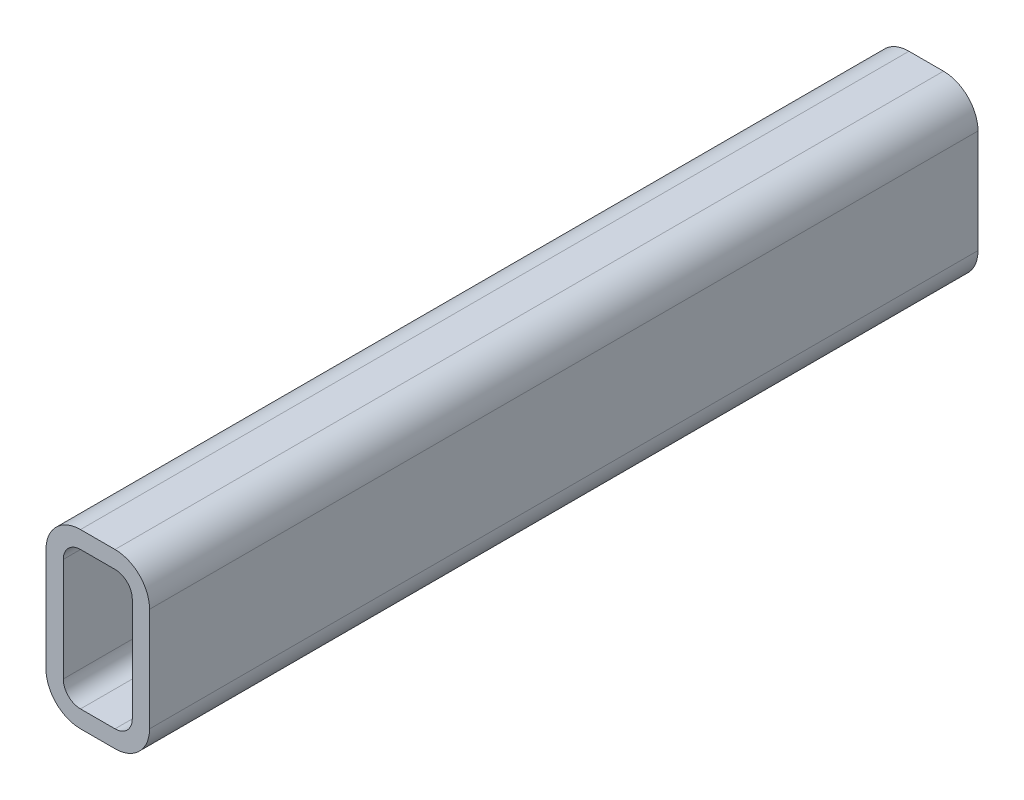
ISO-10303-21;
HEADER;
FILE_DESCRIPTION(('STEP AP214'),'2;1');
FILE_NAME('part.step','',(''),(''),'','','');
FILE_SCHEMA(('AUTOMOTIVE_DESIGN { 1 0 10303 214 1 1 1 1 }'));
ENDSEC;
DATA;
#1=APPLICATION_CONTEXT('core data for automotive mechanical design processes');
#2=APPLICATION_PROTOCOL_DEFINITION('international standard','automotive_design',2000,#1);
#3=PRODUCT_CONTEXT('',#1,'mechanical');
#4=PRODUCT('Part','Part','',(#3));
#5=PRODUCT_RELATED_PRODUCT_CATEGORY('part','',(#4));
#6=PRODUCT_DEFINITION_FORMATION('','',#4);
#7=PRODUCT_DEFINITION_CONTEXT('part definition',#1,'design');
#8=PRODUCT_DEFINITION('design','',#6,#7);
#9=PRODUCT_DEFINITION_SHAPE('','',#8);
#10=(LENGTH_UNIT() NAMED_UNIT(*) SI_UNIT(.MILLI.,.METRE.));
#11=(NAMED_UNIT(*) PLANE_ANGLE_UNIT() SI_UNIT($,.RADIAN.));
#12=(NAMED_UNIT(*) SI_UNIT($,.STERADIAN.) SOLID_ANGLE_UNIT());
#13=UNCERTAINTY_MEASURE_WITH_UNIT(LENGTH_MEASURE(1.E-05),#10,'distance_accuracy_value','');
#14=(GEOMETRIC_REPRESENTATION_CONTEXT(3) GLOBAL_UNCERTAINTY_ASSIGNED_CONTEXT((#13)) GLOBAL_UNIT_ASSIGNED_CONTEXT((#10,
#11,#12)) REPRESENTATION_CONTEXT('',''));
#15=CARTESIAN_POINT('',(0.,0.,0.));
#16=DIRECTION('',(0.,0.,1.));
#17=DIRECTION('',(1.,0.,0.));
#18=AXIS2_PLACEMENT_3D('',#15,#16,#17);
#19=CARTESIAN_POINT('',(12.7,50.8,304.8));
#20=DIRECTION('',(0.,0.,1.));
#21=DIRECTION('',(1.,0.,0.));
#22=AXIS2_PLACEMENT_3D('',#19,#20,#21);
#23=PLANE('',#22);
#24=CARTESIAN_POINT('',(12.7,50.8,304.8));
#25=DIRECTION('',(0.,0.,1.));
#26=DIRECTION('',(1.,0.,0.));
#27=AXIS2_PLACEMENT_3D('',#24,#25,#26);
#28=CIRCLE('',#27,12.7);
#29=CARTESIAN_POINT('',(12.7,63.5,304.8));
#30=VERTEX_POINT('',#29);
#31=CARTESIAN_POINT('',(0.,50.8,304.8));
#32=VERTEX_POINT('',#31);
#33=EDGE_CURVE('E211',#30,#32,#28,.T.);
#34=ORIENTED_EDGE('',*,*,#33,.T.);
#35=DIRECTION('',(0.,-1.,0.));
#36=VECTOR('',#35,1.);
#37=CARTESIAN_POINT('',(0.,12.7,304.8));
#38=LINE('',#37,#36);
#39=CARTESIAN_POINT('',(0.,12.7,304.8));
#40=VERTEX_POINT('',#39);
#41=EDGE_CURVE('E214',#32,#40,#38,.T.);
#42=ORIENTED_EDGE('',*,*,#41,.T.);
#43=CARTESIAN_POINT('',(12.7,12.7,304.8));
#44=DIRECTION('',(0.,0.,1.));
#45=DIRECTION('',(1.,0.,0.));
#46=AXIS2_PLACEMENT_3D('',#43,#44,#45);
#47=CIRCLE('',#46,12.7);
#48=CARTESIAN_POINT('',(12.7,0.,304.8));
#49=VERTEX_POINT('',#48);
#50=EDGE_CURVE('E217',#40,#49,#47,.T.);
#51=ORIENTED_EDGE('',*,*,#50,.T.);
#52=DIRECTION('',(1.,0.,0.));
#53=VECTOR('',#52,1.);
#54=CARTESIAN_POINT('',(25.4,0.,304.8));
#55=LINE('',#54,#53);
#56=CARTESIAN_POINT('',(25.4,0.,304.8));
#57=VERTEX_POINT('',#56);
#58=EDGE_CURVE('E219',#49,#57,#55,.T.);
#59=ORIENTED_EDGE('',*,*,#58,.T.);
#60=CARTESIAN_POINT('',(25.4,12.7,304.8));
#61=DIRECTION('',(0.,0.,1.));
#62=DIRECTION('',(1.,0.,0.));
#63=AXIS2_PLACEMENT_3D('',#60,#61,#62);
#64=CIRCLE('',#63,12.7);
#65=CARTESIAN_POINT('',(38.1,12.7,304.8));
#66=VERTEX_POINT('',#65);
#67=EDGE_CURVE('E221',#57,#66,#64,.T.);
#68=ORIENTED_EDGE('',*,*,#67,.T.);
#69=DIRECTION('',(0.,1.,0.));
#70=VECTOR('',#69,1.);
#71=CARTESIAN_POINT('',(38.1,50.8,304.8));
#72=LINE('',#71,#70);
#73=CARTESIAN_POINT('',(38.1,50.8,304.8));
#74=VERTEX_POINT('',#73);
#75=EDGE_CURVE('E223',#66,#74,#72,.T.);
#76=ORIENTED_EDGE('',*,*,#75,.T.);
#77=CARTESIAN_POINT('',(25.4,50.8,304.8));
#78=DIRECTION('',(0.,0.,1.));
#79=DIRECTION('',(1.,0.,0.));
#80=AXIS2_PLACEMENT_3D('',#77,#78,#79);
#81=CIRCLE('',#80,12.7);
#82=CARTESIAN_POINT('',(25.4,63.5,304.8));
#83=VERTEX_POINT('',#82);
#84=EDGE_CURVE('E225',#74,#83,#81,.T.);
#85=ORIENTED_EDGE('',*,*,#84,.T.);
#86=DIRECTION('',(-1.,0.,0.));
#87=VECTOR('',#86,1.);
#88=CARTESIAN_POINT('',(12.7,63.5,304.8));
#89=LINE('',#88,#87);
#90=EDGE_CURVE('E227',#83,#30,#89,.T.);
#91=ORIENTED_EDGE('',*,*,#90,.T.);
#92=EDGE_LOOP('',(#34,#42,#51,#59,#68,#76,#85,#91));
#93=FACE_BOUND('',#92,.T.);
#94=DIRECTION('',(0.,-1.,0.));
#95=VECTOR('',#94,1.);
#96=CARTESIAN_POINT('',(6.35,12.7,304.8));
#97=LINE('',#96,#95);
#98=CARTESIAN_POINT('',(6.35,50.8,304.8));
#99=VERTEX_POINT('',#98);
#100=CARTESIAN_POINT('',(6.35,12.7,304.8));
#101=VERTEX_POINT('',#100);
#102=EDGE_CURVE('E154',#99,#101,#97,.T.);
#103=ORIENTED_EDGE('',*,*,#102,.F.);
#104=CARTESIAN_POINT('',(12.7,50.8,304.8));
#105=DIRECTION('',(0.,0.,1.));
#106=DIRECTION('',(1.,0.,0.));
#107=AXIS2_PLACEMENT_3D('',#104,#105,#106);
#108=CIRCLE('',#107,6.35);
#109=CARTESIAN_POINT('',(12.7,57.15,304.8));
#110=VERTEX_POINT('',#109);
#111=EDGE_CURVE('E146',#110,#99,#108,.T.);
#112=ORIENTED_EDGE('',*,*,#111,.F.);
#113=DIRECTION('',(-1.,0.,0.));
#114=VECTOR('',#113,1.);
#115=CARTESIAN_POINT('',(12.7,57.15,304.8));
#116=LINE('',#115,#114);
#117=CARTESIAN_POINT('',(25.4,57.15,304.8));
#118=VERTEX_POINT('',#117);
#119=EDGE_CURVE('E179',#118,#110,#116,.T.);
#120=ORIENTED_EDGE('',*,*,#119,.F.);
#121=CARTESIAN_POINT('',(25.4,50.8,304.8));
#122=DIRECTION('',(0.,0.,1.));
#123=DIRECTION('',(1.,0.,0.));
#124=AXIS2_PLACEMENT_3D('',#121,#122,#123);
#125=CIRCLE('',#124,6.35);
#126=CARTESIAN_POINT('',(31.75,50.8,304.8));
#127=VERTEX_POINT('',#126);
#128=EDGE_CURVE('E177',#127,#118,#125,.T.);
#129=ORIENTED_EDGE('',*,*,#128,.F.);
#130=DIRECTION('',(0.,1.,0.));
#131=VECTOR('',#130,1.);
#132=CARTESIAN_POINT('',(31.75,50.8,304.8));
#133=LINE('',#132,#131);
#134=CARTESIAN_POINT('',(31.75,12.7,304.8));
#135=VERTEX_POINT('',#134);
#136=EDGE_CURVE('E175',#135,#127,#133,.T.);
#137=ORIENTED_EDGE('',*,*,#136,.F.);
#138=CARTESIAN_POINT('',(25.4,12.7,304.8));
#139=DIRECTION('',(0.,0.,1.));
#140=DIRECTION('',(1.,0.,0.));
#141=AXIS2_PLACEMENT_3D('',#138,#139,#140);
#142=CIRCLE('',#141,6.35);
#143=CARTESIAN_POINT('',(25.4,6.35,304.8));
#144=VERTEX_POINT('',#143);
#145=EDGE_CURVE('E173',#144,#135,#142,.T.);
#146=ORIENTED_EDGE('',*,*,#145,.F.);
#147=DIRECTION('',(1.,0.,0.));
#148=VECTOR('',#147,1.);
#149=CARTESIAN_POINT('',(25.4,6.35,304.8));
#150=LINE('',#149,#148);
#151=CARTESIAN_POINT('',(12.7,6.35,304.8));
#152=VERTEX_POINT('',#151);
#153=EDGE_CURVE('E169',#152,#144,#150,.T.);
#154=ORIENTED_EDGE('',*,*,#153,.F.);
#155=CARTESIAN_POINT('',(12.7,12.7,304.8));
#156=DIRECTION('',(0.,0.,1.));
#157=DIRECTION('',(1.,0.,0.));
#158=AXIS2_PLACEMENT_3D('',#155,#156,#157);
#159=CIRCLE('',#158,6.35);
#160=EDGE_CURVE('E167',#101,#152,#159,.T.);
#161=ORIENTED_EDGE('',*,*,#160,.F.);
#162=EDGE_LOOP('',(#103,#112,#120,#129,#137,#146,#154,#161));
#163=FACE_BOUND('',#162,.T.);
#164=ADVANCED_FACE('F33',(#93,#163),#23,.T.);
#165=CARTESIAN_POINT('',(12.7,50.8,0.));
#166=DIRECTION('',(0.,0.,1.));
#167=DIRECTION('',(1.,0.,0.));
#168=AXIS2_PLACEMENT_3D('',#165,#166,#167);
#169=PLANE('',#168);
#170=CARTESIAN_POINT('',(12.7,50.8,0.));
#171=DIRECTION('',(0.,0.,1.));
#172=DIRECTION('',(1.,0.,0.));
#173=AXIS2_PLACEMENT_3D('',#170,#171,#172);
#174=CIRCLE('',#173,12.7);
#175=CARTESIAN_POINT('',(12.7,63.5,0.));
#176=VERTEX_POINT('',#175);
#177=CARTESIAN_POINT('',(0.,50.8,0.));
#178=VERTEX_POINT('',#177);
#179=EDGE_CURVE('E162',#176,#178,#174,.T.);
#180=ORIENTED_EDGE('',*,*,#179,.F.);
#181=DIRECTION('',(-1.,0.,0.));
#182=VECTOR('',#181,1.);
#183=CARTESIAN_POINT('',(12.7,63.5,0.));
#184=LINE('',#183,#182);
#185=CARTESIAN_POINT('',(25.4,63.5,0.));
#186=VERTEX_POINT('',#185);
#187=EDGE_CURVE('E215',#186,#176,#184,.T.);
#188=ORIENTED_EDGE('',*,*,#187,.F.);
#189=CARTESIAN_POINT('',(25.4,50.8,0.));
#190=DIRECTION('',(0.,0.,1.));
#191=DIRECTION('',(1.,0.,0.));
#192=AXIS2_PLACEMENT_3D('',#189,#190,#191);
#193=CIRCLE('',#192,12.7);
#194=CARTESIAN_POINT('',(38.1,50.8,0.));
#195=VERTEX_POINT('',#194);
#196=EDGE_CURVE('E242',#195,#186,#193,.T.);
#197=ORIENTED_EDGE('',*,*,#196,.F.);
#198=DIRECTION('',(0.,1.,0.));
#199=VECTOR('',#198,1.);
#200=CARTESIAN_POINT('',(38.1,50.8,0.));
#201=LINE('',#200,#199);
#202=CARTESIAN_POINT('',(38.1,12.7,0.));
#203=VERTEX_POINT('',#202);
#204=EDGE_CURVE('E240',#203,#195,#201,.T.);
#205=ORIENTED_EDGE('',*,*,#204,.F.);
#206=CARTESIAN_POINT('',(25.4,12.7,0.));
#207=DIRECTION('',(0.,0.,1.));
#208=DIRECTION('',(1.,0.,0.));
#209=AXIS2_PLACEMENT_3D('',#206,#207,#208);
#210=CIRCLE('',#209,12.7);
#211=CARTESIAN_POINT('',(25.4,0.,0.));
#212=VERTEX_POINT('',#211);
#213=EDGE_CURVE('E238',#212,#203,#210,.T.);
#214=ORIENTED_EDGE('',*,*,#213,.F.);
#215=DIRECTION('',(1.,0.,0.));
#216=VECTOR('',#215,1.);
#217=CARTESIAN_POINT('',(25.4,0.,0.));
#218=LINE('',#217,#216);
#219=CARTESIAN_POINT('',(12.7,0.,0.));
#220=VERTEX_POINT('',#219);
#221=EDGE_CURVE('E236',#220,#212,#218,.T.);
#222=ORIENTED_EDGE('',*,*,#221,.F.);
#223=CARTESIAN_POINT('',(12.7,12.7,0.));
#224=DIRECTION('',(0.,0.,1.));
#225=DIRECTION('',(1.,0.,0.));
#226=AXIS2_PLACEMENT_3D('',#223,#224,#225);
#227=CIRCLE('',#226,12.7);
#228=CARTESIAN_POINT('',(0.,12.7,0.));
#229=VERTEX_POINT('',#228);
#230=EDGE_CURVE('E234',#229,#220,#227,.T.);
#231=ORIENTED_EDGE('',*,*,#230,.F.);
#232=DIRECTION('',(0.,-1.,0.));
#233=VECTOR('',#232,1.);
#234=CARTESIAN_POINT('',(0.,12.7,0.));
#235=LINE('',#234,#233);
#236=EDGE_CURVE('E232',#178,#229,#235,.T.);
#237=ORIENTED_EDGE('',*,*,#236,.F.);
#238=EDGE_LOOP('',(#180,#188,#197,#205,#214,#222,#231,#237));
#239=FACE_BOUND('',#238,.T.);
#240=CARTESIAN_POINT('',(12.7,50.8,0.));
#241=DIRECTION('',(0.,0.,1.));
#242=DIRECTION('',(1.,0.,0.));
#243=AXIS2_PLACEMENT_3D('',#240,#241,#242);
#244=CIRCLE('',#243,6.35);
#245=CARTESIAN_POINT('',(12.7,57.15,0.));
#246=VERTEX_POINT('',#245);
#247=CARTESIAN_POINT('',(6.35,50.8,0.));
#248=VERTEX_POINT('',#247);
#249=EDGE_CURVE('E56',#246,#248,#244,.T.);
#250=ORIENTED_EDGE('',*,*,#249,.T.);
#251=DIRECTION('',(0.,-1.,0.));
#252=VECTOR('',#251,1.);
#253=CARTESIAN_POINT('',(6.35,12.7,0.));
#254=LINE('',#253,#252);
#255=CARTESIAN_POINT('',(6.35,12.7,0.));
#256=VERTEX_POINT('',#255);
#257=EDGE_CURVE('E161',#248,#256,#254,.T.);
#258=ORIENTED_EDGE('',*,*,#257,.T.);
#259=CARTESIAN_POINT('',(12.7,12.7,0.));
#260=DIRECTION('',(0.,0.,1.));
#261=DIRECTION('',(1.,0.,0.));
#262=AXIS2_PLACEMENT_3D('',#259,#260,#261);
#263=CIRCLE('',#262,6.35);
#264=CARTESIAN_POINT('',(12.7,6.35,0.));
#265=VERTEX_POINT('',#264);
#266=EDGE_CURVE('E183',#256,#265,#263,.T.);
#267=ORIENTED_EDGE('',*,*,#266,.T.);
#268=DIRECTION('',(1.,0.,0.));
#269=VECTOR('',#268,1.);
#270=CARTESIAN_POINT('',(25.4,6.35,0.));
#271=LINE('',#270,#269);
#272=CARTESIAN_POINT('',(25.4,6.35,0.));
#273=VERTEX_POINT('',#272);
#274=EDGE_CURVE('E186',#265,#273,#271,.T.);
#275=ORIENTED_EDGE('',*,*,#274,.T.);
#276=CARTESIAN_POINT('',(25.4,12.7,0.));
#277=DIRECTION('',(0.,0.,1.));
#278=DIRECTION('',(1.,0.,0.));
#279=AXIS2_PLACEMENT_3D('',#276,#277,#278);
#280=CIRCLE('',#279,6.35);
#281=CARTESIAN_POINT('',(31.75,12.7,0.));
#282=VERTEX_POINT('',#281);
#283=EDGE_CURVE('E189',#273,#282,#280,.T.);
#284=ORIENTED_EDGE('',*,*,#283,.T.);
#285=DIRECTION('',(0.,1.,0.));
#286=VECTOR('',#285,1.);
#287=CARTESIAN_POINT('',(31.75,50.8,0.));
#288=LINE('',#287,#286);
#289=CARTESIAN_POINT('',(31.75,50.8,0.));
#290=VERTEX_POINT('',#289);
#291=EDGE_CURVE('E192',#282,#290,#288,.T.);
#292=ORIENTED_EDGE('',*,*,#291,.T.);
#293=CARTESIAN_POINT('',(25.4,50.8,0.));
#294=DIRECTION('',(0.,0.,1.));
#295=DIRECTION('',(1.,0.,0.));
#296=AXIS2_PLACEMENT_3D('',#293,#294,#295);
#297=CIRCLE('',#296,6.35);
#298=CARTESIAN_POINT('',(25.4,57.15,0.));
#299=VERTEX_POINT('',#298);
#300=EDGE_CURVE('E195',#290,#299,#297,.T.);
#301=ORIENTED_EDGE('',*,*,#300,.T.);
#302=DIRECTION('',(-1.,0.,0.));
#303=VECTOR('',#302,1.);
#304=CARTESIAN_POINT('',(12.7,57.15,0.));
#305=LINE('',#304,#303);
#306=EDGE_CURVE('E155',#299,#246,#305,.T.);
#307=ORIENTED_EDGE('',*,*,#306,.T.);
#308=EDGE_LOOP('',(#250,#258,#267,#275,#284,#292,#301,#307));
#309=FACE_BOUND('',#308,.T.);
#310=ADVANCED_FACE('F272',(#239,#309),#169,.F.);
#311=CARTESIAN_POINT('',(12.7,50.8,304.8));
#312=DIRECTION('',(0.,0.,-1.));
#313=DIRECTION('',(-1.,0.,0.));
#314=AXIS2_PLACEMENT_3D('',#311,#312,#313);
#315=CYLINDRICAL_SURFACE('',#314,12.7);
#316=ORIENTED_EDGE('',*,*,#179,.T.);
#317=DIRECTION('',(0.,0.,-1.));
#318=VECTOR('',#317,1.);
#319=CARTESIAN_POINT('',(0.,50.8,304.8));
#320=LINE('',#319,#318);
#321=EDGE_CURVE('E11',#32,#178,#320,.T.);
#322=ORIENTED_EDGE('',*,*,#321,.F.);
#323=ORIENTED_EDGE('',*,*,#33,.F.);
#324=DIRECTION('',(0.,0.,-1.));
#325=VECTOR('',#324,1.);
#326=CARTESIAN_POINT('',(12.7,63.5,304.8));
#327=LINE('',#326,#325);
#328=EDGE_CURVE('E229',#30,#176,#327,.T.);
#329=ORIENTED_EDGE('',*,*,#328,.T.);
#330=EDGE_LOOP('',(#316,#322,#323,#329));
#331=FACE_BOUND('',#330,.T.);
#332=ADVANCED_FACE('F35',(#331),#315,.T.);
#333=CARTESIAN_POINT('',(0.,12.7,304.8));
#334=DIRECTION('',(1.,0.,0.));
#335=DIRECTION('',(0.,0.,-1.));
#336=AXIS2_PLACEMENT_3D('',#333,#334,#335);
#337=PLANE('',#336);
#338=ORIENTED_EDGE('',*,*,#236,.T.);
#339=DIRECTION('',(0.,0.,-1.));
#340=VECTOR('',#339,1.);
#341=CARTESIAN_POINT('',(0.,12.7,304.8));
#342=LINE('',#341,#340);
#343=EDGE_CURVE('E41',#40,#229,#342,.T.);
#344=ORIENTED_EDGE('',*,*,#343,.F.);
#345=ORIENTED_EDGE('',*,*,#41,.F.);
#346=ORIENTED_EDGE('',*,*,#321,.T.);
#347=EDGE_LOOP('',(#338,#344,#345,#346));
#348=FACE_BOUND('',#347,.T.);
#349=ADVANCED_FACE('F289',(#348),#337,.F.);
#350=CARTESIAN_POINT('',(12.7,12.7,304.8));
#351=DIRECTION('',(0.,0.,-1.));
#352=DIRECTION('',(-1.,0.,0.));
#353=AXIS2_PLACEMENT_3D('',#350,#351,#352);
#354=CYLINDRICAL_SURFACE('',#353,12.7);
#355=ORIENTED_EDGE('',*,*,#230,.T.);
#356=DIRECTION('',(0.,0.,-1.));
#357=VECTOR('',#356,1.);
#358=CARTESIAN_POINT('',(12.7,0.,304.8));
#359=LINE('',#358,#357);
#360=EDGE_CURVE('E259',#49,#220,#359,.T.);
#361=ORIENTED_EDGE('',*,*,#360,.F.);
#362=ORIENTED_EDGE('',*,*,#50,.F.);
#363=ORIENTED_EDGE('',*,*,#343,.T.);
#364=EDGE_LOOP('',(#355,#361,#362,#363));
#365=FACE_BOUND('',#364,.T.);
#366=ADVANCED_FACE('F266',(#365),#354,.T.);
#367=CARTESIAN_POINT('',(25.4,0.,304.8));
#368=DIRECTION('',(0.,1.,0.));
#369=DIRECTION('',(0.,0.,1.));
#370=AXIS2_PLACEMENT_3D('',#367,#368,#369);
#371=PLANE('',#370);
#372=ORIENTED_EDGE('',*,*,#221,.T.);
#373=DIRECTION('',(0.,0.,-1.));
#374=VECTOR('',#373,1.);
#375=CARTESIAN_POINT('',(25.4,0.,304.8));
#376=LINE('',#375,#374);
#377=EDGE_CURVE('E256',#57,#212,#376,.T.);
#378=ORIENTED_EDGE('',*,*,#377,.F.);
#379=ORIENTED_EDGE('',*,*,#58,.F.);
#380=ORIENTED_EDGE('',*,*,#360,.T.);
#381=EDGE_LOOP('',(#372,#378,#379,#380));
#382=FACE_BOUND('',#381,.T.);
#383=ADVANCED_FACE('F278',(#382),#371,.F.);
#384=CARTESIAN_POINT('',(25.4,12.7,304.8));
#385=DIRECTION('',(0.,0.,-1.));
#386=DIRECTION('',(-1.,0.,0.));
#387=AXIS2_PLACEMENT_3D('',#384,#385,#386);
#388=CYLINDRICAL_SURFACE('',#387,12.7);
#389=ORIENTED_EDGE('',*,*,#213,.T.);
#390=DIRECTION('',(0.,0.,-1.));
#391=VECTOR('',#390,1.);
#392=CARTESIAN_POINT('',(38.1,12.7,304.8));
#393=LINE('',#392,#391);
#394=EDGE_CURVE('E253',#66,#203,#393,.T.);
#395=ORIENTED_EDGE('',*,*,#394,.F.);
#396=ORIENTED_EDGE('',*,*,#67,.F.);
#397=ORIENTED_EDGE('',*,*,#377,.T.);
#398=EDGE_LOOP('',(#389,#395,#396,#397));
#399=FACE_BOUND('',#398,.T.);
#400=ADVANCED_FACE('F282',(#399),#388,.T.);
#401=CARTESIAN_POINT('',(38.1,50.8,304.8));
#402=DIRECTION('',(-1.,0.,0.));
#403=DIRECTION('',(0.,0.,1.));
#404=AXIS2_PLACEMENT_3D('',#401,#402,#403);
#405=PLANE('',#404);
#406=ORIENTED_EDGE('',*,*,#204,.T.);
#407=DIRECTION('',(0.,0.,-1.));
#408=VECTOR('',#407,1.);
#409=CARTESIAN_POINT('',(38.1,50.8,304.8));
#410=LINE('',#409,#408);
#411=EDGE_CURVE('E250',#74,#195,#410,.T.);
#412=ORIENTED_EDGE('',*,*,#411,.F.);
#413=ORIENTED_EDGE('',*,*,#75,.F.);
#414=ORIENTED_EDGE('',*,*,#394,.T.);
#415=EDGE_LOOP('',(#406,#412,#413,#414));
#416=FACE_BOUND('',#415,.T.);
#417=ADVANCED_FACE('F302',(#416),#405,.F.);
#418=CARTESIAN_POINT('',(25.4,50.8,304.8));
#419=DIRECTION('',(0.,0.,-1.));
#420=DIRECTION('',(-1.,0.,0.));
#421=AXIS2_PLACEMENT_3D('',#418,#419,#420);
#422=CYLINDRICAL_SURFACE('',#421,12.7);
#423=ORIENTED_EDGE('',*,*,#196,.T.);
#424=DIRECTION('',(0.,0.,-1.));
#425=VECTOR('',#424,1.);
#426=CARTESIAN_POINT('',(25.4,63.5,304.8));
#427=LINE('',#426,#425);
#428=EDGE_CURVE('E247',#83,#186,#427,.T.);
#429=ORIENTED_EDGE('',*,*,#428,.F.);
#430=ORIENTED_EDGE('',*,*,#84,.F.);
#431=ORIENTED_EDGE('',*,*,#411,.T.);
#432=EDGE_LOOP('',(#423,#429,#430,#431));
#433=FACE_BOUND('',#432,.T.);
#434=ADVANCED_FACE('F300',(#433),#422,.T.);
#435=CARTESIAN_POINT('',(12.7,63.5,304.8));
#436=DIRECTION('',(0.,-1.,0.));
#437=DIRECTION('',(0.,0.,-1.));
#438=AXIS2_PLACEMENT_3D('',#435,#436,#437);
#439=PLANE('',#438);
#440=ORIENTED_EDGE('',*,*,#187,.T.);
#441=ORIENTED_EDGE('',*,*,#328,.F.);
#442=ORIENTED_EDGE('',*,*,#90,.F.);
#443=ORIENTED_EDGE('',*,*,#428,.T.);
#444=EDGE_LOOP('',(#440,#441,#442,#443));
#445=FACE_BOUND('',#444,.T.);
#446=ADVANCED_FACE('F295',(#445),#439,.F.);
#447=CARTESIAN_POINT('',(12.7,50.8,304.8));
#448=DIRECTION('',(0.,0.,-1.));
#449=DIRECTION('',(-1.,0.,0.));
#450=AXIS2_PLACEMENT_3D('',#447,#448,#449);
#451=CYLINDRICAL_SURFACE('',#450,6.35);
#452=ORIENTED_EDGE('',*,*,#249,.F.);
#453=DIRECTION('',(0.,0.,-1.));
#454=VECTOR('',#453,1.);
#455=CARTESIAN_POINT('',(12.7,57.15,304.8));
#456=LINE('',#455,#454);
#457=EDGE_CURVE('E150',#110,#246,#456,.T.);
#458=ORIENTED_EDGE('',*,*,#457,.F.);
#459=ORIENTED_EDGE('',*,*,#111,.T.);
#460=DIRECTION('',(0.,0.,-1.));
#461=VECTOR('',#460,1.);
#462=CARTESIAN_POINT('',(6.35,50.8,304.8));
#463=LINE('',#462,#461);
#464=EDGE_CURVE('E149',#99,#248,#463,.T.);
#465=ORIENTED_EDGE('',*,*,#464,.T.);
#466=EDGE_LOOP('',(#452,#458,#459,#465));
#467=FACE_BOUND('',#466,.T.);
#468=ADVANCED_FACE('F148',(#467),#451,.F.);
#469=CARTESIAN_POINT('',(6.35,12.7,304.8));
#470=DIRECTION('',(1.,0.,0.));
#471=DIRECTION('',(0.,0.,-1.));
#472=AXIS2_PLACEMENT_3D('',#469,#470,#471);
#473=PLANE('',#472);
#474=ORIENTED_EDGE('',*,*,#257,.F.);
#475=ORIENTED_EDGE('',*,*,#464,.F.);
#476=ORIENTED_EDGE('',*,*,#102,.T.);
#477=DIRECTION('',(0.,0.,-1.));
#478=VECTOR('',#477,1.);
#479=CARTESIAN_POINT('',(6.35,12.7,304.8));
#480=LINE('',#479,#478);
#481=EDGE_CURVE('E163',#101,#256,#480,.T.);
#482=ORIENTED_EDGE('',*,*,#481,.T.);
#483=EDGE_LOOP('',(#474,#475,#476,#482));
#484=FACE_BOUND('',#483,.T.);
#485=ADVANCED_FACE('F158',(#484),#473,.T.);
#486=CARTESIAN_POINT('',(12.7,12.7,304.8));
#487=DIRECTION('',(0.,0.,-1.));
#488=DIRECTION('',(-1.,0.,0.));
#489=AXIS2_PLACEMENT_3D('',#486,#487,#488);
#490=CYLINDRICAL_SURFACE('',#489,6.35);
#491=ORIENTED_EDGE('',*,*,#266,.F.);
#492=ORIENTED_EDGE('',*,*,#481,.F.);
#493=ORIENTED_EDGE('',*,*,#160,.T.);
#494=DIRECTION('',(0.,0.,-1.));
#495=VECTOR('',#494,1.);
#496=CARTESIAN_POINT('',(12.7,6.35,304.8));
#497=LINE('',#496,#495);
#498=EDGE_CURVE('E208',#152,#265,#497,.T.);
#499=ORIENTED_EDGE('',*,*,#498,.T.);
#500=EDGE_LOOP('',(#491,#492,#493,#499));
#501=FACE_BOUND('',#500,.T.);
#502=ADVANCED_FACE('F327',(#501),#490,.F.);
#503=CARTESIAN_POINT('',(25.4,6.35,304.8));
#504=DIRECTION('',(0.,1.,0.));
#505=DIRECTION('',(0.,0.,1.));
#506=AXIS2_PLACEMENT_3D('',#503,#504,#505);
#507=PLANE('',#506);
#508=ORIENTED_EDGE('',*,*,#274,.F.);
#509=ORIENTED_EDGE('',*,*,#498,.F.);
#510=ORIENTED_EDGE('',*,*,#153,.T.);
#511=DIRECTION('',(0.,0.,-1.));
#512=VECTOR('',#511,1.);
#513=CARTESIAN_POINT('',(25.4,6.35,304.8));
#514=LINE('',#513,#512);
#515=EDGE_CURVE('E206',#144,#273,#514,.T.);
#516=ORIENTED_EDGE('',*,*,#515,.T.);
#517=EDGE_LOOP('',(#508,#509,#510,#516));
#518=FACE_BOUND('',#517,.T.);
#519=ADVANCED_FACE('F331',(#518),#507,.T.);
#520=CARTESIAN_POINT('',(25.4,12.7,304.8));
#521=DIRECTION('',(0.,0.,-1.));
#522=DIRECTION('',(-1.,0.,0.));
#523=AXIS2_PLACEMENT_3D('',#520,#521,#522);
#524=CYLINDRICAL_SURFACE('',#523,6.35);
#525=ORIENTED_EDGE('',*,*,#283,.F.);
#526=ORIENTED_EDGE('',*,*,#515,.F.);
#527=ORIENTED_EDGE('',*,*,#145,.T.);
#528=DIRECTION('',(0.,0.,-1.));
#529=VECTOR('',#528,1.);
#530=CARTESIAN_POINT('',(31.75,12.7,304.8));
#531=LINE('',#530,#529);
#532=EDGE_CURVE('E204',#135,#282,#531,.T.);
#533=ORIENTED_EDGE('',*,*,#532,.T.);
#534=EDGE_LOOP('',(#525,#526,#527,#533));
#535=FACE_BOUND('',#534,.T.);
#536=ADVANCED_FACE('F337',(#535),#524,.F.);
#537=CARTESIAN_POINT('',(31.75,50.8,304.8));
#538=DIRECTION('',(-1.,0.,0.));
#539=DIRECTION('',(0.,0.,1.));
#540=AXIS2_PLACEMENT_3D('',#537,#538,#539);
#541=PLANE('',#540);
#542=ORIENTED_EDGE('',*,*,#291,.F.);
#543=ORIENTED_EDGE('',*,*,#532,.F.);
#544=ORIENTED_EDGE('',*,*,#136,.T.);
#545=DIRECTION('',(0.,0.,-1.));
#546=VECTOR('',#545,1.);
#547=CARTESIAN_POINT('',(31.75,50.8,304.8));
#548=LINE('',#547,#546);
#549=EDGE_CURVE('E202',#127,#290,#548,.T.);
#550=ORIENTED_EDGE('',*,*,#549,.T.);
#551=EDGE_LOOP('',(#542,#543,#544,#550));
#552=FACE_BOUND('',#551,.T.);
#553=ADVANCED_FACE('F341',(#552),#541,.T.);
#554=CARTESIAN_POINT('',(25.4,50.8,304.8));
#555=DIRECTION('',(0.,0.,-1.));
#556=DIRECTION('',(-1.,0.,0.));
#557=AXIS2_PLACEMENT_3D('',#554,#555,#556);
#558=CYLINDRICAL_SURFACE('',#557,6.35);
#559=ORIENTED_EDGE('',*,*,#300,.F.);
#560=ORIENTED_EDGE('',*,*,#549,.F.);
#561=ORIENTED_EDGE('',*,*,#128,.T.);
#562=DIRECTION('',(0.,0.,-1.));
#563=VECTOR('',#562,1.);
#564=CARTESIAN_POINT('',(25.4,57.15,304.8));
#565=LINE('',#564,#563);
#566=EDGE_CURVE('E48',#118,#299,#565,.T.);
#567=ORIENTED_EDGE('',*,*,#566,.T.);
#568=EDGE_LOOP('',(#559,#560,#561,#567));
#569=FACE_BOUND('',#568,.T.);
#570=ADVANCED_FACE('F345',(#569),#558,.F.);
#571=CARTESIAN_POINT('',(12.7,57.15,304.8));
#572=DIRECTION('',(0.,-1.,0.));
#573=DIRECTION('',(0.,0.,-1.));
#574=AXIS2_PLACEMENT_3D('',#571,#572,#573);
#575=PLANE('',#574);
#576=ORIENTED_EDGE('',*,*,#306,.F.);
#577=ORIENTED_EDGE('',*,*,#566,.F.);
#578=ORIENTED_EDGE('',*,*,#119,.T.);
#579=ORIENTED_EDGE('',*,*,#457,.T.);
#580=EDGE_LOOP('',(#576,#577,#578,#579));
#581=FACE_BOUND('',#580,.T.);
#582=ADVANCED_FACE('F349',(#581),#575,.T.);
#583=CLOSED_SHELL('',(#164,#310,#332,#349,#366,#383,#400,#417,#434,#446,#468,#485,#502,#519,
#536,#553,#570,#582));
#584=MANIFOLD_SOLID_BREP('B2',#583);
#585=ADVANCED_BREP_SHAPE_REPRESENTATION('',(#18,#584),#14);
#586=SHAPE_DEFINITION_REPRESENTATION(#9,#585);
ENDSEC;
END-ISO-10303-21;
